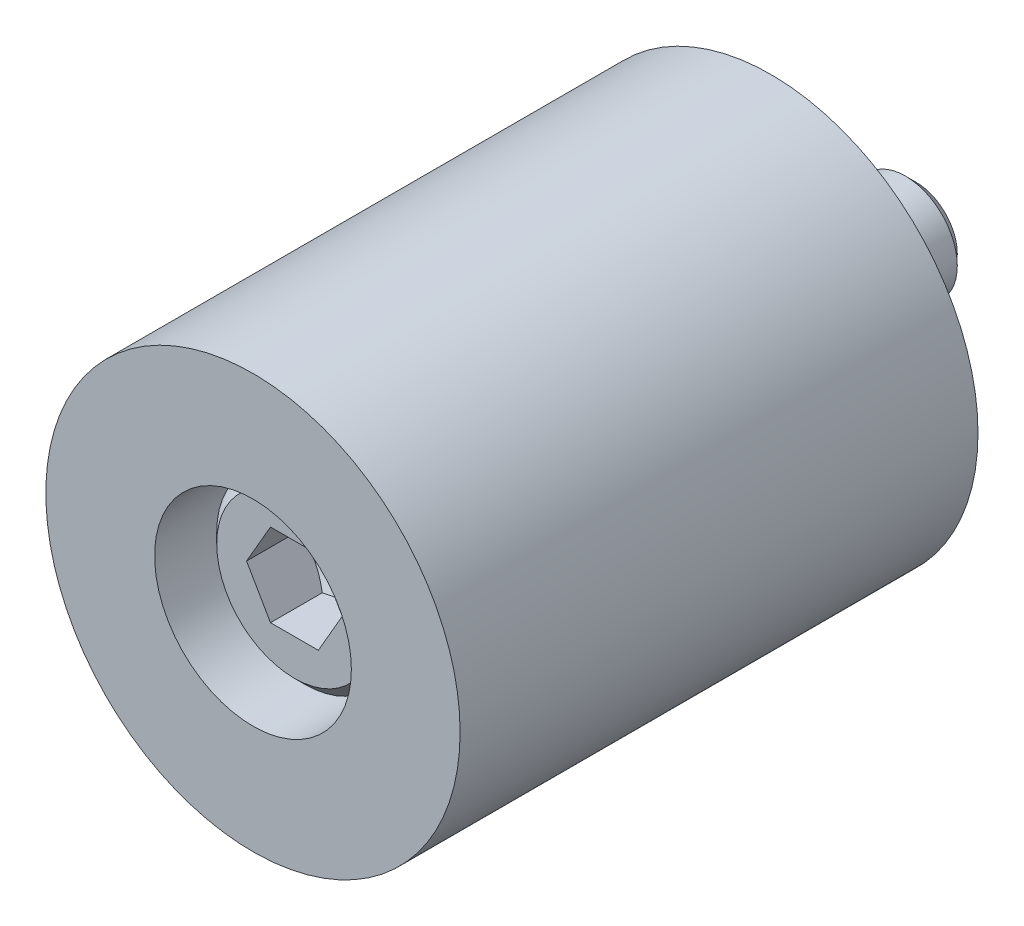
ISO-10303-21;
HEADER;
FILE_DESCRIPTION(('STEP AP214'),'2;1');
FILE_NAME('part.step','',(''),(''),'','','');
FILE_SCHEMA(('AUTOMOTIVE_DESIGN { 1 0 10303 214 1 1 1 1 }'));
ENDSEC;
DATA;
#1=APPLICATION_CONTEXT('core data for automotive mechanical design processes');
#2=APPLICATION_PROTOCOL_DEFINITION('international standard','automotive_design',2000,#1);
#3=PRODUCT_CONTEXT('',#1,'mechanical');
#4=PRODUCT('Part','Part','',(#3));
#5=PRODUCT_RELATED_PRODUCT_CATEGORY('part','',(#4));
#6=PRODUCT_DEFINITION_FORMATION('','',#4);
#7=PRODUCT_DEFINITION_CONTEXT('part definition',#1,'design');
#8=PRODUCT_DEFINITION('design','',#6,#7);
#9=PRODUCT_DEFINITION_SHAPE('','',#8);
#10=(LENGTH_UNIT() NAMED_UNIT(*) SI_UNIT(.MILLI.,.METRE.));
#11=(NAMED_UNIT(*) PLANE_ANGLE_UNIT() SI_UNIT($,.RADIAN.));
#12=(NAMED_UNIT(*) SI_UNIT($,.STERADIAN.) SOLID_ANGLE_UNIT());
#13=UNCERTAINTY_MEASURE_WITH_UNIT(LENGTH_MEASURE(1.E-05),#10,'distance_accuracy_value','');
#14=(GEOMETRIC_REPRESENTATION_CONTEXT(3) GLOBAL_UNCERTAINTY_ASSIGNED_CONTEXT((#13)) GLOBAL_UNIT_ASSIGNED_CONTEXT((#10,
#11,#12)) REPRESENTATION_CONTEXT('',''));
#15=CARTESIAN_POINT('',(0.,0.,0.));
#16=DIRECTION('',(0.,0.,1.));
#17=DIRECTION('',(1.,0.,0.));
#18=AXIS2_PLACEMENT_3D('',#15,#16,#17);
#19=CARTESIAN_POINT('',(0.,0.,12.5));
#20=DIRECTION('',(0.,0.,-1.));
#21=DIRECTION('',(1.,0.,0.));
#22=AXIS2_PLACEMENT_3D('',#19,#20,#21);
#23=CYLINDRICAL_SURFACE('',#22,2.75);
#24=CARTESIAN_POINT('',(0.,0.,18.));
#25=DIRECTION('',(0.,0.,1.));
#26=DIRECTION('',(-1.,0.,0.));
#27=AXIS2_PLACEMENT_3D('',#24,#25,#26);
#28=CIRCLE('',#27,2.75);
#29=CARTESIAN_POINT('',(-2.75,0.,18.));
#30=VERTEX_POINT('',#29);
#31=CARTESIAN_POINT('',(2.75,0.,18.));
#32=VERTEX_POINT('',#31);
#33=EDGE_CURVE('P0_E36',#30,#32,#28,.T.);
#34=ORIENTED_EDGE('',*,*,#33,.T.);
#35=CARTESIAN_POINT('',(2.75,0.,17.9999986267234));
#36=CARTESIAN_POINT('',(2.75,0.,-1.84147465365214E-06));
#37=B_SPLINE_CURVE_WITH_KNOTS('',1,(#35,#36),.UNSPECIFIED.,.F.,.F.,(2,2),(0.0833333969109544,
0.916666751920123),.UNSPECIFIED.);
#38=CARTESIAN_POINT('',(2.75,0.,0.));
#39=VERTEX_POINT('',#38);
#40=EDGE_CURVE('P0_E25',#32,#39,#37,.T.);
#41=ORIENTED_EDGE('',*,*,#40,.T.);
#42=CARTESIAN_POINT('',(0.,0.,0.));
#43=DIRECTION('',(0.,0.,1.));
#44=DIRECTION('',(1.,0.,0.));
#45=AXIS2_PLACEMENT_3D('',#42,#43,#44);
#46=CIRCLE('',#45,2.75000000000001);
#47=EDGE_CURVE('P0_E11',#39,#39,#46,.T.);
#48=ORIENTED_EDGE('',*,*,#47,.F.);
#49=ORIENTED_EDGE('',*,*,#40,.F.);
#50=CARTESIAN_POINT('',(0.,0.,18.));
#51=DIRECTION('',(0.,0.,1.));
#52=DIRECTION('',(-1.,0.,0.));
#53=AXIS2_PLACEMENT_3D('',#50,#51,#52);
#54=CIRCLE('',#53,2.75);
#55=EDGE_CURVE('P0_E51',#32,#30,#54,.T.);
#56=ORIENTED_EDGE('',*,*,#55,.T.);
#57=EDGE_LOOP('',(#34,#41,#48,#49,#56));
#58=FACE_BOUND('',#57,.T.);
#59=ADVANCED_FACE('P0_F16',(#58),#23,.F.);
#60=CARTESIAN_POINT('',(0.,0.,21.5));
#61=DIRECTION('',(0.,0.,-1.));
#62=DIRECTION('',(1.,0.,0.));
#63=AXIS2_PLACEMENT_3D('',#60,#61,#62);
#64=CYLINDRICAL_SURFACE('',#63,4.75);
#65=CARTESIAN_POINT('',(0.,0.,25.));
#66=DIRECTION('',(0.,0.,-1.));
#67=DIRECTION('',(1.,0.,0.));
#68=AXIS2_PLACEMENT_3D('',#65,#66,#67);
#69=CIRCLE('',#68,4.75);
#70=CARTESIAN_POINT('',(4.75,0.,25.));
#71=VERTEX_POINT('',#70);
#72=EDGE_CURVE('P0_E53',#71,#71,#69,.T.);
#73=ORIENTED_EDGE('',*,*,#72,.F.);
#74=CARTESIAN_POINT('',(4.75,0.,24.9999986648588));
#75=CARTESIAN_POINT('',(4.75,0.,18.0000002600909));
#76=B_SPLINE_CURVE_WITH_KNOTS('',1,(#74,#75),.UNSPECIFIED.,.F.,.F.,(2,2),(0.0833334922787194,
0.916666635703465),.UNSPECIFIED.);
#77=CARTESIAN_POINT('',(4.75,0.,18.));
#78=VERTEX_POINT('',#77);
#79=EDGE_CURVE('P0_E91',#71,#78,#76,.T.);
#80=ORIENTED_EDGE('',*,*,#79,.T.);
#81=CARTESIAN_POINT('',(0.,0.,18.));
#82=DIRECTION('',(0.,0.,-1.));
#83=DIRECTION('',(1.,0.,0.));
#84=AXIS2_PLACEMENT_3D('',#81,#82,#83);
#85=CIRCLE('',#84,4.75);
#86=EDGE_CURVE('P0_E94',#78,#78,#85,.T.);
#87=ORIENTED_EDGE('',*,*,#86,.T.);
#88=ORIENTED_EDGE('',*,*,#79,.F.);
#89=EDGE_LOOP('',(#73,#80,#87,#88));
#90=FACE_BOUND('',#89,.T.);
#91=ADVANCED_FACE('P0_F111',(#90),#64,.F.);
#92=CARTESIAN_POINT('',(-10.925,9.8726896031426,18.));
#93=DIRECTION('',(0.,0.,-1.));
#94=DIRECTION('',(1.,0.,0.));
#95=AXIS2_PLACEMENT_3D('',#92,#93,#94);
#96=PLANE('',#95);
#97=ORIENTED_EDGE('',*,*,#86,.F.);
#98=EDGE_LOOP('',(#97));
#99=FACE_BOUND('',#98,.T.);
#100=ORIENTED_EDGE('',*,*,#55,.F.);
#101=ORIENTED_EDGE('',*,*,#33,.F.);
#102=EDGE_LOOP('',(#100,#101));
#103=FACE_BOUND('',#102,.T.);
#104=ADVANCED_FACE('P0_F55',(#99,#103),#96,.F.);
#105=CARTESIAN_POINT('',(0.,0.,12.5));
#106=DIRECTION('',(0.,0.,1.));
#107=DIRECTION('',(1.,0.,0.));
#108=AXIS2_PLACEMENT_3D('',#105,#106,#107);
#109=CYLINDRICAL_SURFACE('',#108,10.);
#110=CARTESIAN_POINT('',(0.,0.,0.));
#111=DIRECTION('',(0.,0.,-1.));
#112=DIRECTION('',(1.,0.,0.));
#113=AXIS2_PLACEMENT_3D('',#110,#111,#112);
#114=CIRCLE('',#113,10.);
#115=CARTESIAN_POINT('',(10.,0.,0.));
#116=VERTEX_POINT('',#115);
#117=EDGE_CURVE('P0_E85',#116,#116,#114,.T.);
#118=ORIENTED_EDGE('',*,*,#117,.F.);
#119=CARTESIAN_POINT('',(10.,0.,-9.53694316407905E-07));
#120=CARTESIAN_POINT('',(10.,0.,24.9999996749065));
#121=B_SPLINE_CURVE_WITH_KNOTS('',1,(#119,#120),.UNSPECIFIED.,.F.,.F.,(2,2),(0.0833333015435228,
0.916666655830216),.UNSPECIFIED.);
#122=CARTESIAN_POINT('',(10.,0.,25.));
#123=VERTEX_POINT('',#122);
#124=EDGE_CURVE('P0_E57',#116,#123,#121,.T.);
#125=ORIENTED_EDGE('',*,*,#124,.T.);
#126=CARTESIAN_POINT('',(0.,0.,25.));
#127=DIRECTION('',(0.,0.,1.));
#128=DIRECTION('',(1.,0.,0.));
#129=AXIS2_PLACEMENT_3D('',#126,#127,#128);
#130=CIRCLE('',#129,10.);
#131=EDGE_CURVE('P0_E82',#123,#123,#130,.T.);
#132=ORIENTED_EDGE('',*,*,#131,.F.);
#133=ORIENTED_EDGE('',*,*,#124,.F.);
#134=EDGE_LOOP('',(#118,#125,#132,#133));
#135=FACE_BOUND('',#134,.T.);
#136=ADVANCED_FACE('P0_F130',(#135),#109,.T.);
#137=CARTESIAN_POINT('',(13.,-20.7846096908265,0.));
#138=DIRECTION('',(0.,0.,-1.));
#139=DIRECTION('',(-1.,0.,0.));
#140=AXIS2_PLACEMENT_3D('',#137,#138,#139);
#141=PLANE('',#140);
#142=ORIENTED_EDGE('',*,*,#117,.T.);
#143=EDGE_LOOP('',(#142));
#144=FACE_BOUND('',#143,.T.);
#145=ORIENTED_EDGE('',*,*,#47,.T.);
#146=EDGE_LOOP('',(#145));
#147=FACE_BOUND('',#146,.T.);
#148=ADVANCED_FACE('P0_F132',(#144,#147),#141,.T.);
#149=CARTESIAN_POINT('',(-23.,-20.7846096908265,25.));
#150=DIRECTION('',(0.,0.,1.));
#151=DIRECTION('',(1.,0.,0.));
#152=AXIS2_PLACEMENT_3D('',#149,#150,#151);
#153=PLANE('',#152);
#154=ORIENTED_EDGE('',*,*,#131,.T.);
#155=EDGE_LOOP('',(#154));
#156=FACE_BOUND('',#155,.T.);
#157=ORIENTED_EDGE('',*,*,#72,.T.);
#158=EDGE_LOOP('',(#157));
#159=FACE_BOUND('',#158,.T.);
#160=ADVANCED_FACE('P0_F108',(#156,#159),#153,.T.);
#161=CLOSED_SHELL('',(#59,#91,#104,#136,#148,#160));
#162=MANIFOLD_SOLID_BREP('P0_B1',#161);
#163=CARTESIAN_POINT('',(0.,0.,-5.46446609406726));
#164=DIRECTION('',(0.,0.,1.));
#165=DIRECTION('',(-1.,0.,0.));
#166=AXIS2_PLACEMENT_3D('',#163,#164,#165);
#167=CONICAL_SURFACE('',#166,3.53553390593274,0.785398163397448);
#168=CARTESIAN_POINT('',(0.,0.,-7.));
#169=DIRECTION('',(0.,0.,1.));
#170=DIRECTION('',(1.,0.,0.));
#171=AXIS2_PLACEMENT_3D('',#168,#169,#170);
#172=CIRCLE('',#171,2.);
#173=CARTESIAN_POINT('',(2.,0.,-7.));
#174=VERTEX_POINT('',#173);
#175=CARTESIAN_POINT('',(-2.,0.,-7.));
#176=VERTEX_POINT('',#175);
#177=EDGE_CURVE('P1_E37',#174,#176,#172,.T.);
#178=ORIENTED_EDGE('',*,*,#177,.T.);
#179=CARTESIAN_POINT('',(-1.99999946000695,0.,-7.00000053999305));
#180=CARTESIAN_POINT('',(-2.49999825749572,0.,-6.50000174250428));
#181=B_SPLINE_CURVE_WITH_KNOTS('',1,(#179,#180),.UNSPECIFIED.,.F.,.F.,(2,2),(0.56568527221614,
0.707106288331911),.UNSPECIFIED.);
#182=CARTESIAN_POINT('',(-2.5,0.,-6.5));
#183=VERTEX_POINT('',#182);
#184=EDGE_CURVE('P1_E24',#176,#183,#181,.T.);
#185=ORIENTED_EDGE('',*,*,#184,.T.);
#186=CARTESIAN_POINT('',(0.,0.,-6.5));
#187=DIRECTION('',(0.,0.,-1.));
#188=DIRECTION('',(1.,0.,0.));
#189=AXIS2_PLACEMENT_3D('',#186,#187,#188);
#190=CIRCLE('',#189,2.5);
#191=CARTESIAN_POINT('',(2.5,0.,-6.5));
#192=VERTEX_POINT('',#191);
#193=EDGE_CURVE('P1_E173',#183,#192,#190,.T.);
#194=ORIENTED_EDGE('',*,*,#193,.T.);
#195=CARTESIAN_POINT('',(0.,0.,-6.5));
#196=DIRECTION('',(0.,0.,-1.));
#197=DIRECTION('',(1.,0.,0.));
#198=AXIS2_PLACEMENT_3D('',#195,#196,#197);
#199=CIRCLE('',#198,2.5);
#200=EDGE_CURVE('P1_E10',#192,#183,#199,.T.);
#201=ORIENTED_EDGE('',*,*,#200,.T.);
#202=ORIENTED_EDGE('',*,*,#184,.F.);
#203=CARTESIAN_POINT('',(0.,0.,-7.));
#204=DIRECTION('',(0.,0.,1.));
#205=DIRECTION('',(1.,0.,0.));
#206=AXIS2_PLACEMENT_3D('',#203,#204,#205);
#207=CIRCLE('',#206,2.);
#208=EDGE_CURVE('P1_E146',#176,#174,#207,.T.);
#209=ORIENTED_EDGE('',*,*,#208,.T.);
#210=EDGE_LOOP('',(#178,#185,#194,#201,#202,#209));
#211=FACE_BOUND('',#210,.T.);
#212=ADVANCED_FACE('P1_F15',(#211),#167,.T.);
#213=CARTESIAN_POINT('',(0.,0.,5.5));
#214=DIRECTION('',(0.,0.,-1.));
#215=DIRECTION('',(1.,0.,0.));
#216=AXIS2_PLACEMENT_3D('',#213,#214,#215);
#217=CYLINDRICAL_SURFACE('',#216,2.5);
#218=CARTESIAN_POINT('',(0.,0.,18.));
#219=DIRECTION('',(0.,0.,1.));
#220=DIRECTION('',(1.,0.,0.));
#221=AXIS2_PLACEMENT_3D('',#218,#219,#220);
#222=CIRCLE('',#221,2.5);
#223=CARTESIAN_POINT('',(2.5,0.,18.));
#224=VERTEX_POINT('',#223);
#225=EDGE_CURVE('P1_E154',#224,#224,#222,.T.);
#226=ORIENTED_EDGE('',*,*,#225,.F.);
#227=CARTESIAN_POINT('',(2.5,0.,18.0000009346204));
#228=CARTESIAN_POINT('',(2.5,0.,-6.49999968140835));
#229=B_SPLINE_CURVE_WITH_KNOTS('',1,(#227,#228),.UNSPECIFIED.,.F.,.F.,(2,2),(0.0833333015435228,
0.916666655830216),.UNSPECIFIED.);
#230=EDGE_CURVE('P1_E127',#224,#192,#229,.T.);
#231=ORIENTED_EDGE('',*,*,#230,.T.);
#232=ORIENTED_EDGE('',*,*,#193,.F.);
#233=ORIENTED_EDGE('',*,*,#200,.F.);
#234=ORIENTED_EDGE('',*,*,#230,.F.);
#235=EDGE_LOOP('',(#226,#231,#232,#233,#234));
#236=FACE_BOUND('',#235,.T.);
#237=ADVANCED_FACE('P1_F337',(#236),#217,.T.);
#238=CARTESIAN_POINT('',(-4.6,4.1569219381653,-7.));
#239=DIRECTION('',(0.,0.,-1.));
#240=DIRECTION('',(1.,0.,0.));
#241=AXIS2_PLACEMENT_3D('',#238,#239,#240);
#242=PLANE('',#241);
#243=ORIENTED_EDGE('',*,*,#208,.F.);
#244=ORIENTED_EDGE('',*,*,#177,.F.);
#245=EDGE_LOOP('',(#243,#244));
#246=FACE_BOUND('',#245,.T.);
#247=ADVANCED_FACE('P1_F340',(#246),#242,.T.);
#248=CARTESIAN_POINT('',(0.,0.,20.7395923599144));
#249=DIRECTION('',(0.,0.,-1.));
#250=DIRECTION('',(-1.,0.,0.));
#251=AXIS2_PLACEMENT_3D('',#248,#249,#250);
#252=CONICAL_SURFACE('',#251,6.01040764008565,0.785398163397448);
#253=CARTESIAN_POINT('',(0.,0.,23.));
#254=DIRECTION('',(0.,0.,-1.));
#255=DIRECTION('',(1.,0.,0.));
#256=AXIS2_PLACEMENT_3D('',#253,#254,#255);
#257=CIRCLE('',#256,3.75);
#258=CARTESIAN_POINT('',(3.75,0.,23.));
#259=VERTEX_POINT('',#258);
#260=CARTESIAN_POINT('',(-3.75,0.,23.));
#261=VERTEX_POINT('',#260);
#262=EDGE_CURVE('P1_E102',#259,#261,#257,.T.);
#263=ORIENTED_EDGE('',*,*,#262,.T.);
#264=CARTESIAN_POINT('',(-3.75000185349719,0.,22.9999981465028));
#265=CARTESIAN_POINT('',(-4.24999855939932,0.,22.5000014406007));
#266=B_SPLINE_CURVE_WITH_KNOTS('',1,(#264,#265),.UNSPECIFIED.,.F.,.F.,(2,2),(0.623918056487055,
0.707106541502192),.UNSPECIFIED.);
#267=CARTESIAN_POINT('',(-4.25,0.,22.5));
#268=VERTEX_POINT('',#267);
#269=EDGE_CURVE('P1_E107',#261,#268,#266,.T.);
#270=ORIENTED_EDGE('',*,*,#269,.T.);
#271=CARTESIAN_POINT('',(0.,0.,22.5));
#272=DIRECTION('',(0.,0.,1.));
#273=DIRECTION('',(1.,0.,0.));
#274=AXIS2_PLACEMENT_3D('',#271,#272,#273);
#275=CIRCLE('',#274,4.25);
#276=CARTESIAN_POINT('',(4.25,0.,22.5));
#277=VERTEX_POINT('',#276);
#278=EDGE_CURVE('P1_E117',#268,#277,#275,.T.);
#279=ORIENTED_EDGE('',*,*,#278,.T.);
#280=CARTESIAN_POINT('',(0.,0.,22.5));
#281=DIRECTION('',(0.,0.,1.));
#282=DIRECTION('',(1.,0.,0.));
#283=AXIS2_PLACEMENT_3D('',#280,#281,#282);
#284=CIRCLE('',#283,4.25);
#285=EDGE_CURVE('P1_E119',#277,#268,#284,.T.);
#286=ORIENTED_EDGE('',*,*,#285,.T.);
#287=ORIENTED_EDGE('',*,*,#269,.F.);
#288=CARTESIAN_POINT('',(0.,0.,23.));
#289=DIRECTION('',(0.,0.,-1.));
#290=DIRECTION('',(1.,0.,0.));
#291=AXIS2_PLACEMENT_3D('',#288,#289,#290);
#292=CIRCLE('',#291,3.75);
#293=EDGE_CURVE('P1_E109',#261,#259,#292,.T.);
#294=ORIENTED_EDGE('',*,*,#293,.T.);
#295=EDGE_LOOP('',(#263,#270,#279,#286,#287,#294));
#296=FACE_BOUND('',#295,.T.);
#297=ADVANCED_FACE('P1_F104',(#296),#252,.T.);
#298=CARTESIAN_POINT('',(0.,0.,20.5));
#299=DIRECTION('',(0.,0.,1.));
#300=DIRECTION('',(1.,0.,0.));
#301=AXIS2_PLACEMENT_3D('',#298,#299,#300);
#302=CYLINDRICAL_SURFACE('',#301,4.25);
#303=CARTESIAN_POINT('',(0.,0.,18.));
#304=DIRECTION('',(0.,0.,-1.));
#305=DIRECTION('',(1.,0.,0.));
#306=AXIS2_PLACEMENT_3D('',#303,#304,#305);
#307=CIRCLE('',#306,4.25);
#308=CARTESIAN_POINT('',(4.25,0.,18.));
#309=VERTEX_POINT('',#308);
#310=EDGE_CURVE('P1_E112',#309,#309,#307,.T.);
#311=ORIENTED_EDGE('',*,*,#310,.F.);
#312=CARTESIAN_POINT('',(4.25,0.,18.0000013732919));
#313=CARTESIAN_POINT('',(4.25,0.,22.5000005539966));
#314=B_SPLINE_CURVE_WITH_KNOTS('',1,(#312,#313),.UNSPECIFIED.,.F.,.F.,(2,2),(0.083333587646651,
0.916666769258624),.UNSPECIFIED.);
#315=EDGE_CURVE('P1_E317',#309,#277,#314,.T.);
#316=ORIENTED_EDGE('',*,*,#315,.T.);
#317=ORIENTED_EDGE('',*,*,#278,.F.);
#318=ORIENTED_EDGE('',*,*,#285,.F.);
#319=ORIENTED_EDGE('',*,*,#315,.F.);
#320=EDGE_LOOP('',(#311,#316,#317,#318,#319));
#321=FACE_BOUND('',#320,.T.);
#322=ADVANCED_FACE('P1_F348',(#321),#302,.T.);
#323=CARTESIAN_POINT('',(-8.625,-7.79422863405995,23.));
#324=DIRECTION('',(0.,0.,1.));
#325=DIRECTION('',(1.,0.,0.));
#326=AXIS2_PLACEMENT_3D('',#323,#324,#325);
#327=PLANE('',#326);
#328=ORIENTED_EDGE('',*,*,#293,.F.);
#329=ORIENTED_EDGE('',*,*,#262,.F.);
#330=EDGE_LOOP('',(#328,#329));
#331=FACE_BOUND('',#330,.T.);
#332=DIRECTION('',(-0.500000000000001,0.866025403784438,0.));
#333=VECTOR('',#332,1.);
#334=CARTESIAN_POINT('',(-1.15470053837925,-2.,23.));
#335=LINE('',#334,#333);
#336=CARTESIAN_POINT('',(-1.15470053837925,-2.,23.));
#337=VERTEX_POINT('',#336);
#338=CARTESIAN_POINT('',(-2.3094010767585,0.,23.));
#339=VERTEX_POINT('',#338);
#340=EDGE_CURVE('P1_E312',#337,#339,#335,.T.);
#341=ORIENTED_EDGE('',*,*,#340,.T.);
#342=DIRECTION('',(0.5,0.866025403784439,0.));
#343=VECTOR('',#342,1.);
#344=CARTESIAN_POINT('',(-2.3094010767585,0.,23.));
#345=LINE('',#344,#343);
#346=CARTESIAN_POINT('',(-1.15470053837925,2.,23.));
#347=VERTEX_POINT('',#346);
#348=EDGE_CURVE('P1_E306',#339,#347,#345,.T.);
#349=ORIENTED_EDGE('',*,*,#348,.T.);
#350=DIRECTION('',(1.,0.,0.));
#351=VECTOR('',#350,1.);
#352=CARTESIAN_POINT('',(-1.15470053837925,2.,23.));
#353=LINE('',#352,#351);
#354=CARTESIAN_POINT('',(1.15470053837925,2.,23.));
#355=VERTEX_POINT('',#354);
#356=EDGE_CURVE('P1_E300',#347,#355,#353,.T.);
#357=ORIENTED_EDGE('',*,*,#356,.T.);
#358=DIRECTION('',(0.500000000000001,-0.866025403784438,0.));
#359=VECTOR('',#358,1.);
#360=CARTESIAN_POINT('',(1.15470053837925,2.,23.));
#361=LINE('',#360,#359);
#362=CARTESIAN_POINT('',(2.3094010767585,0.,23.));
#363=VERTEX_POINT('',#362);
#364=EDGE_CURVE('P1_E294',#355,#363,#361,.T.);
#365=ORIENTED_EDGE('',*,*,#364,.T.);
#366=DIRECTION('',(-0.499999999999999,-0.866025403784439,0.));
#367=VECTOR('',#366,1.);
#368=CARTESIAN_POINT('',(2.3094010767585,0.,23.));
#369=LINE('',#368,#367);
#370=CARTESIAN_POINT('',(1.15470053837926,-2.,23.));
#371=VERTEX_POINT('',#370);
#372=EDGE_CURVE('P1_E288',#363,#371,#369,.T.);
#373=ORIENTED_EDGE('',*,*,#372,.T.);
#374=DIRECTION('',(-1.,0.,0.));
#375=VECTOR('',#374,1.);
#376=CARTESIAN_POINT('',(1.15470053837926,-2.,23.));
#377=LINE('',#376,#375);
#378=EDGE_CURVE('P1_E277',#371,#337,#377,.T.);
#379=ORIENTED_EDGE('',*,*,#378,.T.);
#380=EDGE_LOOP('',(#341,#349,#357,#365,#373,#379));
#381=FACE_BOUND('',#380,.T.);
#382=ADVANCED_FACE('P1_F114',(#331,#381),#327,.T.);
#383=CARTESIAN_POINT('',(0.,0.,20.9480313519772));
#384=DIRECTION('',(0.,0.,1.));
#385=DIRECTION('',(-1.,0.,0.));
#386=AXIS2_PLACEMENT_3D('',#383,#384,#385);
#387=CONICAL_SURFACE('',#386,3.05505046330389,1.02974425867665);
#388=CARTESIAN_POINT('',(0.,0.,19.122371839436));
#389=DIRECTION('',(0.,0.,-1.));
#390=DIRECTION('',(-1.,0.,0.));
#391=AXIS2_PLACEMENT_3D('',#388,#389,#390);
#392=CIRCLE('',#391,0.0166427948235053);
#393=CARTESIAN_POINT('',(-0.0166427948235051,0.,19.122371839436));
#394=VERTEX_POINT('',#393);
#395=EDGE_CURVE('P1_E216',#394,#394,#392,.T.);
#396=ORIENTED_EDGE('',*,*,#395,.T.);
#397=CARTESIAN_POINT('',(-0.0166459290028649,0.,19.1223737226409));
#398=CARTESIAN_POINT('',(-2.30940054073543,0.,20.4999996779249));
#399=B_SPLINE_CURVE_WITH_KNOTS('',1,(#397,#398),.UNSPECIFIED.,.F.,.F.,(2,2),
(0.00544865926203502,0.755928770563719),.UNSPECIFIED.);
#400=CARTESIAN_POINT('',(-2.3094010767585,0.,20.5));
#401=VERTEX_POINT('',#400);
#402=EDGE_CURVE('P1_E221',#394,#401,#399,.T.);
#403=ORIENTED_EDGE('',*,*,#402,.T.);
#404=CARTESIAN_POINT('',(-2.3094010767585,0.,20.5));
#405=CARTESIAN_POINT('',(-1.73205080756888,-0.999999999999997,20.153092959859));
#406=CARTESIAN_POINT('',(-1.15470053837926,-2.,20.5));
#407=(BOUNDED_CURVE() B_SPLINE_CURVE(2,(#404,#405,#406),.UNSPECIFIED.,.F.,
.F.) B_SPLINE_CURVE_WITH_KNOTS((3,3),(0.,2.33914062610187),
.UNSPECIFIED.) CURVE() GEOMETRIC_REPRESENTATION_ITEM() RATIONAL_B_SPLINE_CURVE((1.,
1.15470053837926,1.)) REPRESENTATION_ITEM(''));
#408=CARTESIAN_POINT('',(-1.15470053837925,-2.,20.5));
#409=VERTEX_POINT('',#408);
#410=EDGE_CURVE('P1_E227',#401,#409,#407,.T.);
#411=ORIENTED_EDGE('',*,*,#410,.T.);
#412=CARTESIAN_POINT('',(-1.15470053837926,-2.,20.5));
#413=CARTESIAN_POINT('',(0.,-2.,20.153092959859));
#414=CARTESIAN_POINT('',(1.15470053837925,-2.,20.5));
#415=(BOUNDED_CURVE() B_SPLINE_CURVE(2,(#412,#413,#414),.UNSPECIFIED.,.F.,
.F.) B_SPLINE_CURVE_WITH_KNOTS((3,3),(0.,2.33914062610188),
.UNSPECIFIED.) CURVE() GEOMETRIC_REPRESENTATION_ITEM() RATIONAL_B_SPLINE_CURVE((1.,
1.15470053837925,1.)) REPRESENTATION_ITEM(''));
#416=CARTESIAN_POINT('',(1.15470053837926,-2.,20.5));
#417=VERTEX_POINT('',#416);
#418=EDGE_CURVE('P1_E224',#409,#417,#415,.T.);
#419=ORIENTED_EDGE('',*,*,#418,.T.);
#420=CARTESIAN_POINT('',(1.15470053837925,-2.,20.5));
#421=CARTESIAN_POINT('',(1.73205080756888,-1.,20.153092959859));
#422=CARTESIAN_POINT('',(2.3094010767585,0.,20.5));
#423=(BOUNDED_CURVE() B_SPLINE_CURVE(2,(#420,#421,#422),.UNSPECIFIED.,.F.,
.F.) B_SPLINE_CURVE_WITH_KNOTS((3,3),(0.,2.33914062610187),
.UNSPECIFIED.) CURVE() GEOMETRIC_REPRESENTATION_ITEM() RATIONAL_B_SPLINE_CURVE((1.,
1.15470053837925,1.)) REPRESENTATION_ITEM(''));
#424=CARTESIAN_POINT('',(2.3094010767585,0.,20.5));
#425=VERTEX_POINT('',#424);
#426=EDGE_CURVE('P1_E267',#417,#425,#423,.T.);
#427=ORIENTED_EDGE('',*,*,#426,.T.);
#428=CARTESIAN_POINT('',(2.3094010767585,0.,20.5));
#429=CARTESIAN_POINT('',(1.73205080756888,0.999999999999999,20.153092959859));
#430=CARTESIAN_POINT('',(1.15470053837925,2.,20.5));
#431=(BOUNDED_CURVE() B_SPLINE_CURVE(2,(#428,#429,#430),.UNSPECIFIED.,.F.,
.F.) B_SPLINE_CURVE_WITH_KNOTS((3,3),(0.,2.33914062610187),
.UNSPECIFIED.) CURVE() GEOMETRIC_REPRESENTATION_ITEM() RATIONAL_B_SPLINE_CURVE((1.,
1.15470053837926,1.)) REPRESENTATION_ITEM(''));
#432=CARTESIAN_POINT('',(1.15470053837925,2.,20.5));
#433=VERTEX_POINT('',#432);
#434=EDGE_CURVE('P1_E257',#425,#433,#431,.T.);
#435=ORIENTED_EDGE('',*,*,#434,.T.);
#436=CARTESIAN_POINT('',(1.15470053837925,2.,20.5));
#437=CARTESIAN_POINT('',(0.,2.,20.153092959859));
#438=CARTESIAN_POINT('',(-1.15470053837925,2.,20.5));
#439=(BOUNDED_CURVE() B_SPLINE_CURVE(2,(#436,#437,#438),.UNSPECIFIED.,.F.,
.F.) B_SPLINE_CURVE_WITH_KNOTS((3,3),(0.,2.33914062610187),
.UNSPECIFIED.) CURVE() GEOMETRIC_REPRESENTATION_ITEM() RATIONAL_B_SPLINE_CURVE((1.,
1.15470053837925,1.)) REPRESENTATION_ITEM(''));
#440=CARTESIAN_POINT('',(-1.15470053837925,2.,20.5));
#441=VERTEX_POINT('',#440);
#442=EDGE_CURVE('P1_E247',#433,#441,#439,.T.);
#443=ORIENTED_EDGE('',*,*,#442,.T.);
#444=CARTESIAN_POINT('',(-1.15470053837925,2.,20.5));
#445=CARTESIAN_POINT('',(-1.73205080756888,1.,20.153092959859));
#446=CARTESIAN_POINT('',(-2.3094010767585,0.,20.5));
#447=(BOUNDED_CURVE() B_SPLINE_CURVE(2,(#444,#445,#446),.UNSPECIFIED.,.F.,
.F.) B_SPLINE_CURVE_WITH_KNOTS((3,3),(0.,2.33914062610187),
.UNSPECIFIED.) CURVE() GEOMETRIC_REPRESENTATION_ITEM() RATIONAL_B_SPLINE_CURVE((1.,
1.15470053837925,1.)) REPRESENTATION_ITEM(''));
#448=EDGE_CURVE('P1_E237',#441,#401,#447,.T.);
#449=ORIENTED_EDGE('',*,*,#448,.T.);
#450=ORIENTED_EDGE('',*,*,#402,.F.);
#451=EDGE_LOOP('',(#396,#403,#411,#419,#427,#435,#443,#449,#450));
#452=FACE_BOUND('',#451,.T.);
#453=ADVANCED_FACE('P1_F390',(#452),#387,.F.);
#454=CARTESIAN_POINT('',(0.0382784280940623,-0.0345913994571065,19.122371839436));
#455=DIRECTION('',(0.,0.,-1.));
#456=DIRECTION('',(-1.,0.,0.));
#457=AXIS2_PLACEMENT_3D('',#454,#455,#456);
#458=PLANE('',#457);
#459=ORIENTED_EDGE('',*,*,#395,.F.);
#460=EDGE_LOOP('',(#459));
#461=FACE_BOUND('',#460,.T.);
#462=ADVANCED_FACE('P1_F398',(#461),#458,.F.);
#463=CARTESIAN_POINT('',(-1.03923048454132,-2.2,23.2846907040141));
#464=DIRECTION('',(-0.866025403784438,-0.500000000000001,0.));
#465=DIRECTION('',(-0.500000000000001,0.866025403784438,0.));
#466=AXIS2_PLACEMENT_3D('',#463,#464,#465);
#467=PLANE('',#466);
#468=DIRECTION('',(0.,0.,-1.));
#469=VECTOR('',#468,1.);
#470=CARTESIAN_POINT('',(-2.3094010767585,0.,23.));
#471=LINE('',#470,#469);
#472=EDGE_CURVE('P1_E210',#339,#401,#471,.T.);
#473=ORIENTED_EDGE('',*,*,#472,.F.);
#474=ORIENTED_EDGE('',*,*,#340,.F.);
#475=DIRECTION('',(0.,0.,-1.));
#476=VECTOR('',#475,1.);
#477=CARTESIAN_POINT('',(-1.15470053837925,-2.,23.));
#478=LINE('',#477,#476);
#479=EDGE_CURVE('P1_E204',#337,#409,#478,.T.);
#480=ORIENTED_EDGE('',*,*,#479,.T.);
#481=ORIENTED_EDGE('',*,*,#410,.F.);
#482=EDGE_LOOP('',(#473,#474,#480,#481));
#483=FACE_BOUND('',#482,.T.);
#484=ADVANCED_FACE('P1_F407',(#483),#467,.F.);
#485=CARTESIAN_POINT('',(1.38564064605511,-2.,23.2846907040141));
#486=DIRECTION('',(0.,-1.,0.));
#487=DIRECTION('',(-1.,0.,0.));
#488=AXIS2_PLACEMENT_3D('',#485,#486,#487);
#489=PLANE('',#488);
#490=ORIENTED_EDGE('',*,*,#479,.F.);
#491=ORIENTED_EDGE('',*,*,#378,.F.);
#492=DIRECTION('',(0.,0.,-1.));
#493=VECTOR('',#492,1.);
#494=CARTESIAN_POINT('',(1.15470053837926,-2.,23.));
#495=LINE('',#494,#493);
#496=EDGE_CURVE('P1_E198',#371,#417,#495,.T.);
#497=ORIENTED_EDGE('',*,*,#496,.T.);
#498=ORIENTED_EDGE('',*,*,#418,.F.);
#499=EDGE_LOOP('',(#490,#491,#497,#498));
#500=FACE_BOUND('',#499,.T.);
#501=ADVANCED_FACE('P1_F416',(#500),#489,.F.);
#502=CARTESIAN_POINT('',(2.42487113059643,0.200000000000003,23.2846907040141));
#503=DIRECTION('',(0.866025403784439,-0.499999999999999,0.));
#504=DIRECTION('',(-0.499999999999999,-0.866025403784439,0.));
#505=AXIS2_PLACEMENT_3D('',#502,#503,#504);
#506=PLANE('',#505);
#507=ORIENTED_EDGE('',*,*,#496,.F.);
#508=ORIENTED_EDGE('',*,*,#372,.F.);
#509=DIRECTION('',(0.,0.,-1.));
#510=VECTOR('',#509,1.);
#511=CARTESIAN_POINT('',(2.3094010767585,0.,23.));
#512=LINE('',#511,#510);
#513=EDGE_CURVE('P1_E192',#363,#425,#512,.T.);
#514=ORIENTED_EDGE('',*,*,#513,.T.);
#515=ORIENTED_EDGE('',*,*,#426,.F.);
#516=EDGE_LOOP('',(#507,#508,#514,#515));
#517=FACE_BOUND('',#516,.T.);
#518=ADVANCED_FACE('P1_F425',(#517),#506,.F.);
#519=CARTESIAN_POINT('',(1.03923048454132,2.2,23.2846907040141));
#520=DIRECTION('',(0.866025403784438,0.500000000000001,0.));
#521=DIRECTION('',(0.500000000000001,-0.866025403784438,0.));
#522=AXIS2_PLACEMENT_3D('',#519,#520,#521);
#523=PLANE('',#522);
#524=ORIENTED_EDGE('',*,*,#513,.F.);
#525=ORIENTED_EDGE('',*,*,#364,.F.);
#526=DIRECTION('',(0.,0.,-1.));
#527=VECTOR('',#526,1.);
#528=CARTESIAN_POINT('',(1.15470053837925,2.,23.));
#529=LINE('',#528,#527);
#530=EDGE_CURVE('P1_E186',#355,#433,#529,.T.);
#531=ORIENTED_EDGE('',*,*,#530,.T.);
#532=ORIENTED_EDGE('',*,*,#434,.F.);
#533=EDGE_LOOP('',(#524,#525,#531,#532));
#534=FACE_BOUND('',#533,.T.);
#535=ADVANCED_FACE('P1_F434',(#534),#523,.F.);
#536=CARTESIAN_POINT('',(-1.3856406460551,2.,23.2846907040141));
#537=DIRECTION('',(0.,1.,0.));
#538=DIRECTION('',(1.,0.,0.));
#539=AXIS2_PLACEMENT_3D('',#536,#537,#538);
#540=PLANE('',#539);
#541=ORIENTED_EDGE('',*,*,#530,.F.);
#542=ORIENTED_EDGE('',*,*,#356,.F.);
#543=DIRECTION('',(0.,0.,-1.));
#544=VECTOR('',#543,1.);
#545=CARTESIAN_POINT('',(-1.15470053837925,2.,23.));
#546=LINE('',#545,#544);
#547=EDGE_CURVE('P1_E178',#347,#441,#546,.T.);
#548=ORIENTED_EDGE('',*,*,#547,.T.);
#549=ORIENTED_EDGE('',*,*,#442,.F.);
#550=EDGE_LOOP('',(#541,#542,#548,#549));
#551=FACE_BOUND('',#550,.T.);
#552=ADVANCED_FACE('P1_F443',(#551),#540,.F.);
#553=CARTESIAN_POINT('',(-2.42487113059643,-0.200000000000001,23.2846907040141));
#554=DIRECTION('',(-0.866025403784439,0.5,0.));
#555=DIRECTION('',(0.5,0.866025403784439,0.));
#556=AXIS2_PLACEMENT_3D('',#553,#554,#555);
#557=PLANE('',#556);
#558=ORIENTED_EDGE('',*,*,#547,.F.);
#559=ORIENTED_EDGE('',*,*,#348,.F.);
#560=ORIENTED_EDGE('',*,*,#472,.T.);
#561=ORIENTED_EDGE('',*,*,#448,.F.);
#562=EDGE_LOOP('',(#558,#559,#560,#561));
#563=FACE_BOUND('',#562,.T.);
#564=ADVANCED_FACE('P1_F452',(#563),#557,.F.);
#565=CARTESIAN_POINT('',(5.525,-8.83345911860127,18.));
#566=DIRECTION('',(0.,0.,-1.));
#567=DIRECTION('',(-1.,0.,0.));
#568=AXIS2_PLACEMENT_3D('',#565,#566,#567);
#569=PLANE('',#568);
#570=ORIENTED_EDGE('',*,*,#310,.T.);
#571=EDGE_LOOP('',(#570));
#572=FACE_BOUND('',#571,.T.);
#573=ORIENTED_EDGE('',*,*,#225,.T.);
#574=EDGE_LOOP('',(#573));
#575=FACE_BOUND('',#574,.T.);
#576=ADVANCED_FACE('P1_F336',(#572,#575),#569,.T.);
#577=CLOSED_SHELL('',(#212,#237,#247,#297,#322,#382,#453,#462,#484,#501,#518,#535,#552,#564,#576));
#578=MANIFOLD_SOLID_BREP('P1_B1',#577);
#579=ADVANCED_BREP_SHAPE_REPRESENTATION('',(#18,#162,#578),#14);
#580=SHAPE_DEFINITION_REPRESENTATION(#9,#579);
ENDSEC;
END-ISO-10303-21;
